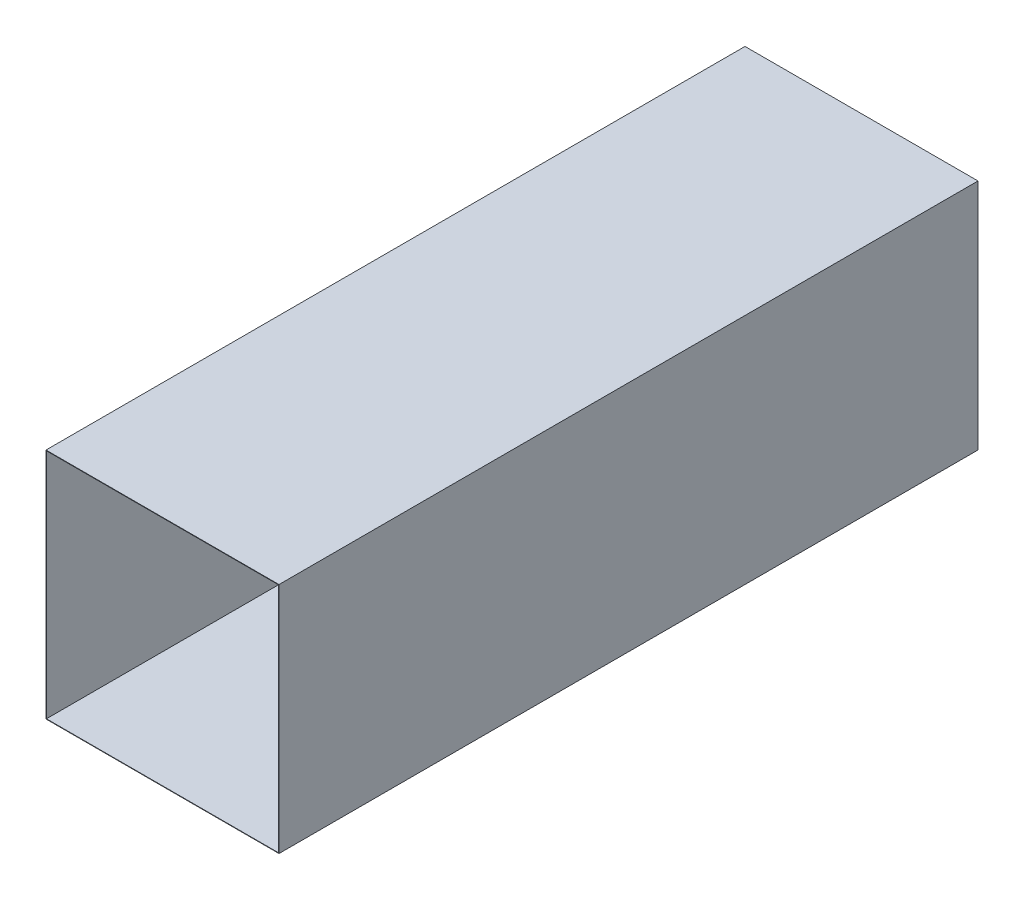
ISO-10303-21;
HEADER;
FILE_DESCRIPTION(('STEP AP214'),'2;1');
FILE_NAME('part.step','',(''),(''),'','','');
FILE_SCHEMA(('AUTOMOTIVE_DESIGN { 1 0 10303 214 1 1 1 1 }'));
ENDSEC;
DATA;
#1=APPLICATION_CONTEXT('core data for automotive mechanical design processes');
#2=APPLICATION_PROTOCOL_DEFINITION('international standard','automotive_design',2000,#1);
#3=PRODUCT_CONTEXT('',#1,'mechanical');
#4=PRODUCT('Part','Part','',(#3));
#5=PRODUCT_RELATED_PRODUCT_CATEGORY('part','',(#4));
#6=PRODUCT_DEFINITION_FORMATION('','',#4);
#7=PRODUCT_DEFINITION_CONTEXT('part definition',#1,'design');
#8=PRODUCT_DEFINITION('design','',#6,#7);
#9=PRODUCT_DEFINITION_SHAPE('','',#8);
#10=(LENGTH_UNIT() NAMED_UNIT(*) SI_UNIT(.MILLI.,.METRE.));
#11=(NAMED_UNIT(*) PLANE_ANGLE_UNIT() SI_UNIT($,.RADIAN.));
#12=(NAMED_UNIT(*) SI_UNIT($,.STERADIAN.) SOLID_ANGLE_UNIT());
#13=UNCERTAINTY_MEASURE_WITH_UNIT(LENGTH_MEASURE(1.E-05),#10,'distance_accuracy_value','');
#14=(GEOMETRIC_REPRESENTATION_CONTEXT(3) GLOBAL_UNCERTAINTY_ASSIGNED_CONTEXT((#13)) GLOBAL_UNIT_ASSIGNED_CONTEXT((#10,
#11,#12)) REPRESENTATION_CONTEXT('',''));
#15=CARTESIAN_POINT('',(0.,0.,0.));
#16=DIRECTION('',(0.,0.,1.));
#17=DIRECTION('',(1.,0.,0.));
#18=AXIS2_PLACEMENT_3D('',#15,#16,#17);
#19=CARTESIAN_POINT('',(0.,0.,3000.));
#20=DIRECTION('',(0.,0.,1.));
#21=DIRECTION('',(1.,0.,0.));
#22=AXIS2_PLACEMENT_3D('',#19,#20,#21);
#23=PLANE('',#22);
#24=DIRECTION('',(0.,1.,0.));
#25=VECTOR('',#24,1.);
#26=CARTESIAN_POINT('',(500.,500.,3000.));
#27=LINE('',#26,#25);
#28=CARTESIAN_POINT('',(500.,-500.,3000.));
#29=VERTEX_POINT('',#28);
#30=CARTESIAN_POINT('',(500.,500.,3000.));
#31=VERTEX_POINT('',#30);
#32=EDGE_CURVE('E159',#29,#31,#27,.T.);
#33=ORIENTED_EDGE('',*,*,#32,.T.);
#34=DIRECTION('',(-1.,0.,0.));
#35=VECTOR('',#34,1.);
#36=CARTESIAN_POINT('',(-500.,500.,3000.));
#37=LINE('',#36,#35);
#38=CARTESIAN_POINT('',(-500.,500.,3000.));
#39=VERTEX_POINT('',#38);
#40=EDGE_CURVE('E162',#31,#39,#37,.T.);
#41=ORIENTED_EDGE('',*,*,#40,.T.);
#42=DIRECTION('',(0.,-1.,0.));
#43=VECTOR('',#42,1.);
#44=CARTESIAN_POINT('',(-500.,500.,3000.));
#45=LINE('',#44,#43);
#46=CARTESIAN_POINT('',(-500.,-500.,3000.));
#47=VERTEX_POINT('',#46);
#48=EDGE_CURVE('E165',#39,#47,#45,.T.);
#49=ORIENTED_EDGE('',*,*,#48,.T.);
#50=DIRECTION('',(1.,0.,0.));
#51=VECTOR('',#50,1.);
#52=CARTESIAN_POINT('',(-500.,-500.,3000.));
#53=LINE('',#52,#51);
#54=EDGE_CURVE('E167',#47,#29,#53,.T.);
#55=ORIENTED_EDGE('',*,*,#54,.T.);
#56=EDGE_LOOP('',(#33,#41,#49,#55));
#57=FACE_BOUND('',#56,.T.);
#58=DIRECTION('',(-1.,0.,0.));
#59=VECTOR('',#58,1.);
#60=CARTESIAN_POINT('',(-500.,498.,3000.));
#61=LINE('',#60,#59);
#62=CARTESIAN_POINT('',(498.,498.,3000.));
#63=VERTEX_POINT('',#62);
#64=CARTESIAN_POINT('',(-498.,498.,3000.));
#65=VERTEX_POINT('',#64);
#66=EDGE_CURVE('E131',#63,#65,#61,.T.);
#67=ORIENTED_EDGE('',*,*,#66,.F.);
#68=DIRECTION('',(0.,1.,0.));
#69=VECTOR('',#68,1.);
#70=CARTESIAN_POINT('',(498.,500.,3000.));
#71=LINE('',#70,#69);
#72=CARTESIAN_POINT('',(498.,-498.,3000.));
#73=VERTEX_POINT('',#72);
#74=EDGE_CURVE('E123',#73,#63,#71,.T.);
#75=ORIENTED_EDGE('',*,*,#74,.F.);
#76=DIRECTION('',(1.,0.,0.));
#77=VECTOR('',#76,1.);
#78=CARTESIAN_POINT('',(-500.,-498.,3000.));
#79=LINE('',#78,#77);
#80=CARTESIAN_POINT('',(-498.,-498.,3000.));
#81=VERTEX_POINT('',#80);
#82=EDGE_CURVE('E145',#81,#73,#79,.T.);
#83=ORIENTED_EDGE('',*,*,#82,.F.);
#84=DIRECTION('',(0.,-1.,0.));
#85=VECTOR('',#84,1.);
#86=CARTESIAN_POINT('',(-498.,500.,3000.));
#87=LINE('',#86,#85);
#88=EDGE_CURVE('E143',#65,#81,#87,.T.);
#89=ORIENTED_EDGE('',*,*,#88,.F.);
#90=EDGE_LOOP('',(#67,#75,#83,#89));
#91=FACE_BOUND('',#90,.T.);
#92=ADVANCED_FACE('F58',(#57,#91),#23,.T.);
#93=CARTESIAN_POINT('',(0.,0.,0.));
#94=DIRECTION('',(0.,0.,1.));
#95=DIRECTION('',(1.,0.,0.));
#96=AXIS2_PLACEMENT_3D('',#93,#94,#95);
#97=PLANE('',#96);
#98=DIRECTION('',(0.,1.,0.));
#99=VECTOR('',#98,1.);
#100=CARTESIAN_POINT('',(500.,500.,0.));
#101=LINE('',#100,#99);
#102=CARTESIAN_POINT('',(500.,-500.,0.));
#103=VERTEX_POINT('',#102);
#104=CARTESIAN_POINT('',(500.,500.,0.));
#105=VERTEX_POINT('',#104);
#106=EDGE_CURVE('E139',#103,#105,#101,.T.);
#107=ORIENTED_EDGE('',*,*,#106,.F.);
#108=DIRECTION('',(1.,0.,0.));
#109=VECTOR('',#108,1.);
#110=CARTESIAN_POINT('',(-500.,-500.,0.));
#111=LINE('',#110,#109);
#112=CARTESIAN_POINT('',(-500.,-500.,0.));
#113=VERTEX_POINT('',#112);
#114=EDGE_CURVE('E163',#113,#103,#111,.T.);
#115=ORIENTED_EDGE('',*,*,#114,.F.);
#116=DIRECTION('',(0.,-1.,0.));
#117=VECTOR('',#116,1.);
#118=CARTESIAN_POINT('',(-500.,500.,0.));
#119=LINE('',#118,#117);
#120=CARTESIAN_POINT('',(-500.,500.,0.));
#121=VERTEX_POINT('',#120);
#122=EDGE_CURVE('E174',#121,#113,#119,.T.);
#123=ORIENTED_EDGE('',*,*,#122,.F.);
#124=DIRECTION('',(-1.,0.,0.));
#125=VECTOR('',#124,1.);
#126=CARTESIAN_POINT('',(-500.,500.,0.));
#127=LINE('',#126,#125);
#128=EDGE_CURVE('E172',#105,#121,#127,.T.);
#129=ORIENTED_EDGE('',*,*,#128,.F.);
#130=EDGE_LOOP('',(#107,#115,#123,#129));
#131=FACE_BOUND('',#130,.T.);
#132=DIRECTION('',(0.,1.,0.));
#133=VECTOR('',#132,1.);
#134=CARTESIAN_POINT('',(498.,500.,0.));
#135=LINE('',#134,#133);
#136=CARTESIAN_POINT('',(498.,-498.,0.));
#137=VERTEX_POINT('',#136);
#138=CARTESIAN_POINT('',(498.,498.,0.));
#139=VERTEX_POINT('',#138);
#140=EDGE_CURVE('E81',#137,#139,#135,.T.);
#141=ORIENTED_EDGE('',*,*,#140,.T.);
#142=DIRECTION('',(-1.,0.,0.));
#143=VECTOR('',#142,1.);
#144=CARTESIAN_POINT('',(-500.,498.,0.));
#145=LINE('',#144,#143);
#146=CARTESIAN_POINT('',(-498.,498.,0.));
#147=VERTEX_POINT('',#146);
#148=EDGE_CURVE('E138',#139,#147,#145,.T.);
#149=ORIENTED_EDGE('',*,*,#148,.T.);
#150=DIRECTION('',(0.,-1.,0.));
#151=VECTOR('',#150,1.);
#152=CARTESIAN_POINT('',(-498.,500.,0.));
#153=LINE('',#152,#151);
#154=CARTESIAN_POINT('',(-498.,-498.,0.));
#155=VERTEX_POINT('',#154);
#156=EDGE_CURVE('E151',#147,#155,#153,.T.);
#157=ORIENTED_EDGE('',*,*,#156,.T.);
#158=DIRECTION('',(1.,0.,0.));
#159=VECTOR('',#158,1.);
#160=CARTESIAN_POINT('',(-500.,-498.,0.));
#161=LINE('',#160,#159);
#162=EDGE_CURVE('E132',#155,#137,#161,.T.);
#163=ORIENTED_EDGE('',*,*,#162,.T.);
#164=EDGE_LOOP('',(#141,#149,#157,#163));
#165=FACE_BOUND('',#164,.T.);
#166=ADVANCED_FACE('F192',(#131,#165),#97,.F.);
#167=CARTESIAN_POINT('',(500.,500.,3000.));
#168=DIRECTION('',(-1.,0.,0.));
#169=DIRECTION('',(0.,-1.,0.));
#170=AXIS2_PLACEMENT_3D('',#167,#168,#169);
#171=PLANE('',#170);
#172=ORIENTED_EDGE('',*,*,#106,.T.);
#173=DIRECTION('',(0.,0.,-1.));
#174=VECTOR('',#173,1.);
#175=CARTESIAN_POINT('',(500.,500.,3000.));
#176=LINE('',#175,#174);
#177=EDGE_CURVE('E12',#31,#105,#176,.T.);
#178=ORIENTED_EDGE('',*,*,#177,.F.);
#179=ORIENTED_EDGE('',*,*,#32,.F.);
#180=DIRECTION('',(0.,0.,-1.));
#181=VECTOR('',#180,1.);
#182=CARTESIAN_POINT('',(500.,-500.,3000.));
#183=LINE('',#182,#181);
#184=EDGE_CURVE('E169',#29,#103,#183,.T.);
#185=ORIENTED_EDGE('',*,*,#184,.T.);
#186=EDGE_LOOP('',(#172,#178,#179,#185));
#187=FACE_BOUND('',#186,.T.);
#188=ADVANCED_FACE('F60',(#187),#171,.F.);
#189=CARTESIAN_POINT('',(-500.,500.,3000.));
#190=DIRECTION('',(0.,-1.,0.));
#191=DIRECTION('',(0.,0.,-1.));
#192=AXIS2_PLACEMENT_3D('',#189,#190,#191);
#193=PLANE('',#192);
#194=ORIENTED_EDGE('',*,*,#128,.T.);
#195=DIRECTION('',(0.,0.,-1.));
#196=VECTOR('',#195,1.);
#197=CARTESIAN_POINT('',(-500.,500.,3000.));
#198=LINE('',#197,#196);
#199=EDGE_CURVE('E66',#39,#121,#198,.T.);
#200=ORIENTED_EDGE('',*,*,#199,.F.);
#201=ORIENTED_EDGE('',*,*,#40,.F.);
#202=ORIENTED_EDGE('',*,*,#177,.T.);
#203=EDGE_LOOP('',(#194,#200,#201,#202));
#204=FACE_BOUND('',#203,.T.);
#205=ADVANCED_FACE('F202',(#204),#193,.F.);
#206=CARTESIAN_POINT('',(-500.,500.,3000.));
#207=DIRECTION('',(1.,0.,0.));
#208=DIRECTION('',(0.,1.,0.));
#209=AXIS2_PLACEMENT_3D('',#206,#207,#208);
#210=PLANE('',#209);
#211=ORIENTED_EDGE('',*,*,#122,.T.);
#212=DIRECTION('',(0.,0.,-1.));
#213=VECTOR('',#212,1.);
#214=CARTESIAN_POINT('',(-500.,-500.,3000.));
#215=LINE('',#214,#213);
#216=EDGE_CURVE('E179',#47,#113,#215,.T.);
#217=ORIENTED_EDGE('',*,*,#216,.F.);
#218=ORIENTED_EDGE('',*,*,#48,.F.);
#219=ORIENTED_EDGE('',*,*,#199,.T.);
#220=EDGE_LOOP('',(#211,#217,#218,#219));
#221=FACE_BOUND('',#220,.T.);
#222=ADVANCED_FACE('F186',(#221),#210,.F.);
#223=CARTESIAN_POINT('',(-500.,-500.,3000.));
#224=DIRECTION('',(0.,1.,0.));
#225=DIRECTION('',(0.,0.,1.));
#226=AXIS2_PLACEMENT_3D('',#223,#224,#225);
#227=PLANE('',#226);
#228=ORIENTED_EDGE('',*,*,#114,.T.);
#229=ORIENTED_EDGE('',*,*,#184,.F.);
#230=ORIENTED_EDGE('',*,*,#54,.F.);
#231=ORIENTED_EDGE('',*,*,#216,.T.);
#232=EDGE_LOOP('',(#228,#229,#230,#231));
#233=FACE_BOUND('',#232,.T.);
#234=ADVANCED_FACE('F196',(#233),#227,.F.);
#235=CARTESIAN_POINT('',(498.,500.,3000.));
#236=DIRECTION('',(-1.,0.,0.));
#237=DIRECTION('',(0.,-1.,0.));
#238=AXIS2_PLACEMENT_3D('',#235,#236,#237);
#239=PLANE('',#238);
#240=ORIENTED_EDGE('',*,*,#140,.F.);
#241=DIRECTION('',(0.,0.,-1.));
#242=VECTOR('',#241,1.);
#243=CARTESIAN_POINT('',(498.,-498.,3000.));
#244=LINE('',#243,#242);
#245=EDGE_CURVE('E127',#73,#137,#244,.T.);
#246=ORIENTED_EDGE('',*,*,#245,.F.);
#247=ORIENTED_EDGE('',*,*,#74,.T.);
#248=DIRECTION('',(0.,0.,-1.));
#249=VECTOR('',#248,1.);
#250=CARTESIAN_POINT('',(498.,498.,3000.));
#251=LINE('',#250,#249);
#252=EDGE_CURVE('E126',#63,#139,#251,.T.);
#253=ORIENTED_EDGE('',*,*,#252,.T.);
#254=EDGE_LOOP('',(#240,#246,#247,#253));
#255=FACE_BOUND('',#254,.T.);
#256=ADVANCED_FACE('F125',(#255),#239,.T.);
#257=CARTESIAN_POINT('',(-500.,498.,3000.));
#258=DIRECTION('',(0.,-1.,0.));
#259=DIRECTION('',(0.,0.,-1.));
#260=AXIS2_PLACEMENT_3D('',#257,#258,#259);
#261=PLANE('',#260);
#262=ORIENTED_EDGE('',*,*,#148,.F.);
#263=ORIENTED_EDGE('',*,*,#252,.F.);
#264=ORIENTED_EDGE('',*,*,#66,.T.);
#265=DIRECTION('',(0.,0.,-1.));
#266=VECTOR('',#265,1.);
#267=CARTESIAN_POINT('',(-498.,498.,3000.));
#268=LINE('',#267,#266);
#269=EDGE_CURVE('E140',#65,#147,#268,.T.);
#270=ORIENTED_EDGE('',*,*,#269,.T.);
#271=EDGE_LOOP('',(#262,#263,#264,#270));
#272=FACE_BOUND('',#271,.T.);
#273=ADVANCED_FACE('F135',(#272),#261,.T.);
#274=CARTESIAN_POINT('',(-498.,500.,3000.));
#275=DIRECTION('',(1.,0.,0.));
#276=DIRECTION('',(0.,1.,0.));
#277=AXIS2_PLACEMENT_3D('',#274,#275,#276);
#278=PLANE('',#277);
#279=ORIENTED_EDGE('',*,*,#156,.F.);
#280=ORIENTED_EDGE('',*,*,#269,.F.);
#281=ORIENTED_EDGE('',*,*,#88,.T.);
#282=DIRECTION('',(0.,0.,-1.));
#283=VECTOR('',#282,1.);
#284=CARTESIAN_POINT('',(-498.,-498.,3000.));
#285=LINE('',#284,#283);
#286=EDGE_CURVE('E73',#81,#155,#285,.T.);
#287=ORIENTED_EDGE('',*,*,#286,.T.);
#288=EDGE_LOOP('',(#279,#280,#281,#287));
#289=FACE_BOUND('',#288,.T.);
#290=ADVANCED_FACE('F225',(#289),#278,.T.);
#291=CARTESIAN_POINT('',(-500.,-498.,3000.));
#292=DIRECTION('',(0.,1.,0.));
#293=DIRECTION('',(0.,0.,1.));
#294=AXIS2_PLACEMENT_3D('',#291,#292,#293);
#295=PLANE('',#294);
#296=ORIENTED_EDGE('',*,*,#162,.F.);
#297=ORIENTED_EDGE('',*,*,#286,.F.);
#298=ORIENTED_EDGE('',*,*,#82,.T.);
#299=ORIENTED_EDGE('',*,*,#245,.T.);
#300=EDGE_LOOP('',(#296,#297,#298,#299));
#301=FACE_BOUND('',#300,.T.);
#302=ADVANCED_FACE('F229',(#301),#295,.T.);
#303=CLOSED_SHELL('',(#92,#166,#188,#205,#222,#234,#256,#273,#290,#302));
#304=MANIFOLD_SOLID_BREP('B2',#303);
#305=ADVANCED_BREP_SHAPE_REPRESENTATION('',(#18,#304),#14);
#306=SHAPE_DEFINITION_REPRESENTATION(#9,#305);
ENDSEC;
END-ISO-10303-21;
